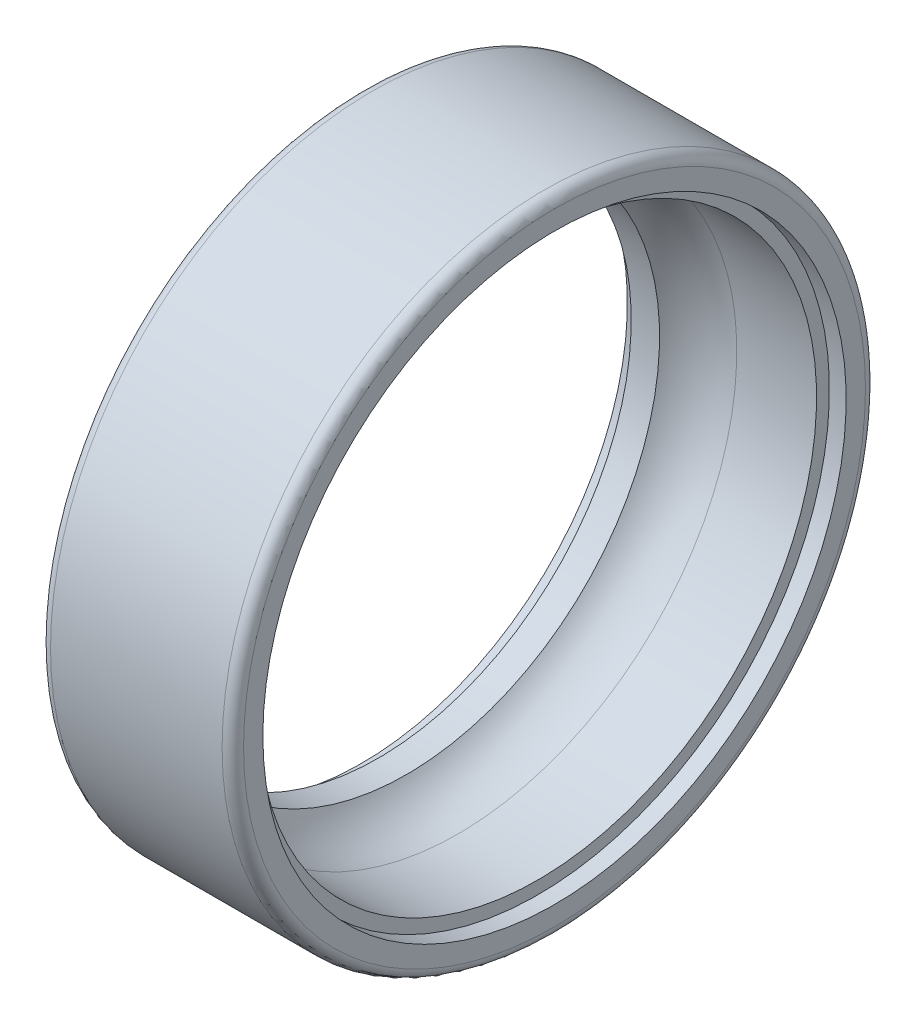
ISO-10303-21;
HEADER;
FILE_DESCRIPTION(('STEP AP214'),'2;1');
FILE_NAME('part.step','',(''),(''),'','','');
FILE_SCHEMA(('AUTOMOTIVE_DESIGN { 1 0 10303 214 1 1 1 1 }'));
ENDSEC;
DATA;
#1=APPLICATION_CONTEXT('core data for automotive mechanical design processes');
#2=APPLICATION_PROTOCOL_DEFINITION('international standard','automotive_design',2000,#1);
#3=PRODUCT_CONTEXT('',#1,'mechanical');
#4=PRODUCT('Part','Part','',(#3));
#5=PRODUCT_RELATED_PRODUCT_CATEGORY('part','',(#4));
#6=PRODUCT_DEFINITION_FORMATION('','',#4);
#7=PRODUCT_DEFINITION_CONTEXT('part definition',#1,'design');
#8=PRODUCT_DEFINITION('design','',#6,#7);
#9=PRODUCT_DEFINITION_SHAPE('','',#8);
#10=(LENGTH_UNIT() NAMED_UNIT(*) SI_UNIT(.MILLI.,.METRE.));
#11=(NAMED_UNIT(*) PLANE_ANGLE_UNIT() SI_UNIT($,.RADIAN.));
#12=(NAMED_UNIT(*) SI_UNIT($,.STERADIAN.) SOLID_ANGLE_UNIT());
#13=UNCERTAINTY_MEASURE_WITH_UNIT(LENGTH_MEASURE(1.E-05),#10,'distance_accuracy_value','');
#14=(GEOMETRIC_REPRESENTATION_CONTEXT(3) GLOBAL_UNCERTAINTY_ASSIGNED_CONTEXT((#13)) GLOBAL_UNIT_ASSIGNED_CONTEXT((#10,
#11,#12)) REPRESENTATION_CONTEXT('',''));
#15=CARTESIAN_POINT('',(0.,0.,0.));
#16=DIRECTION('',(0.,0.,1.));
#17=DIRECTION('',(1.,0.,0.));
#18=AXIS2_PLACEMENT_3D('',#15,#16,#17);
#19=CARTESIAN_POINT('',(4.5,0.,0.));
#20=DIRECTION('',(-1.,0.,0.));
#21=DIRECTION('',(0.,0.,1.));
#22=AXIS2_PLACEMENT_3D('',#19,#20,#21);
#23=TOROIDAL_SURFACE('',#22,10.,3.);
#24=CARTESIAN_POINT('',(2.1,0.,0.));
#25=DIRECTION('',(-1.,0.,0.));
#26=DIRECTION('',(0.,0.,1.));
#27=AXIS2_PLACEMENT_3D('',#24,#25,#26);
#28=CIRCLE('',#27,11.8);
#29=CARTESIAN_POINT('',(2.1,0.,11.8));
#30=VERTEX_POINT('',#29);
#31=EDGE_CURVE('E127',#30,#30,#28,.T.);
#32=ORIENTED_EDGE('',*,*,#31,.T.);
#33=EDGE_LOOP('',(#32));
#34=FACE_BOUND('',#33,.T.);
#35=CARTESIAN_POINT('',(4.5,0.,0.));
#36=DIRECTION('',(-1.,0.,0.));
#37=DIRECTION('',(0.,0.,1.));
#38=AXIS2_PLACEMENT_3D('',#35,#36,#37);
#39=CIRCLE('',#38,13.);
#40=CARTESIAN_POINT('',(4.5,0.,13.));
#41=VERTEX_POINT('',#40);
#42=EDGE_CURVE('E137',#41,#41,#39,.F.);
#43=ORIENTED_EDGE('',*,*,#42,.T.);
#44=EDGE_LOOP('',(#43));
#45=FACE_BOUND('',#44,.T.);
#46=ADVANCED_FACE('F14',(#34,#45),#23,.F.);
#47=CARTESIAN_POINT('',(1.44,0.,0.));
#48=DIRECTION('',(-1.,0.,0.));
#49=DIRECTION('',(0.,0.,1.));
#50=AXIS2_PLACEMENT_3D('',#47,#48,#49);
#51=CYLINDRICAL_SURFACE('',#50,11.8);
#52=CARTESIAN_POINT('',(0.78,0.,0.));
#53=DIRECTION('',(-1.,0.,0.));
#54=DIRECTION('',(0.,0.,1.));
#55=AXIS2_PLACEMENT_3D('',#52,#53,#54);
#56=CIRCLE('',#55,11.8);
#57=CARTESIAN_POINT('',(0.78,0.,11.8));
#58=VERTEX_POINT('',#57);
#59=EDGE_CURVE('E18',#58,#58,#56,.F.);
#60=ORIENTED_EDGE('',*,*,#59,.F.);
#61=EDGE_LOOP('',(#60));
#62=FACE_BOUND('',#61,.T.);
#63=ORIENTED_EDGE('',*,*,#31,.F.);
#64=EDGE_LOOP('',(#63));
#65=FACE_BOUND('',#64,.T.);
#66=ADVANCED_FACE('F97',(#62,#65),#51,.F.);
#67=CARTESIAN_POINT('',(6.36,0.,0.));
#68=DIRECTION('',(-1.,0.,0.));
#69=DIRECTION('',(0.,0.,1.));
#70=AXIS2_PLACEMENT_3D('',#67,#68,#69);
#71=CYLINDRICAL_SURFACE('',#70,13.);
#72=ORIENTED_EDGE('',*,*,#42,.F.);
#73=EDGE_LOOP('',(#72));
#74=FACE_BOUND('',#73,.T.);
#75=CARTESIAN_POINT('',(8.22,0.,0.));
#76=DIRECTION('',(-1.,0.,0.));
#77=DIRECTION('',(0.,0.,1.));
#78=AXIS2_PLACEMENT_3D('',#75,#76,#77);
#79=CIRCLE('',#78,13.);
#80=CARTESIAN_POINT('',(8.22,0.,13.));
#81=VERTEX_POINT('',#80);
#82=EDGE_CURVE('E133',#81,#81,#79,.T.);
#83=ORIENTED_EDGE('',*,*,#82,.F.);
#84=EDGE_LOOP('',(#83));
#85=FACE_BOUND('',#84,.T.);
#86=ADVANCED_FACE('F94',(#74,#85),#71,.F.);
#87=CARTESIAN_POINT('',(0.78,12.1,0.));
#88=DIRECTION('',(-1.,0.,0.));
#89=DIRECTION('',(0.,0.,1.));
#90=AXIS2_PLACEMENT_3D('',#87,#88,#89);
#91=PLANE('',#90);
#92=ORIENTED_EDGE('',*,*,#59,.T.);
#93=EDGE_LOOP('',(#92));
#94=FACE_BOUND('',#93,.T.);
#95=CARTESIAN_POINT('',(0.78,0.,0.));
#96=DIRECTION('',(-1.,0.,0.));
#97=DIRECTION('',(0.,0.,1.));
#98=AXIS2_PLACEMENT_3D('',#95,#96,#97);
#99=CIRCLE('',#98,12.4);
#100=CARTESIAN_POINT('',(0.78,0.,12.4));
#101=VERTEX_POINT('',#100);
#102=EDGE_CURVE('E131',#101,#101,#99,.T.);
#103=ORIENTED_EDGE('',*,*,#102,.T.);
#104=EDGE_LOOP('',(#103));
#105=FACE_BOUND('',#104,.T.);
#106=ADVANCED_FACE('F90',(#94,#105),#91,.T.);
#107=CARTESIAN_POINT('',(8.22,13.3,0.));
#108=DIRECTION('',(1.,0.,0.));
#109=DIRECTION('',(0.,0.,-1.));
#110=AXIS2_PLACEMENT_3D('',#107,#108,#109);
#111=PLANE('',#110);
#112=ORIENTED_EDGE('',*,*,#82,.T.);
#113=EDGE_LOOP('',(#112));
#114=FACE_BOUND('',#113,.T.);
#115=CARTESIAN_POINT('',(8.22,0.,0.));
#116=DIRECTION('',(-1.,0.,0.));
#117=DIRECTION('',(0.,0.,1.));
#118=AXIS2_PLACEMENT_3D('',#115,#116,#117);
#119=CIRCLE('',#118,13.6);
#120=CARTESIAN_POINT('',(8.22,0.,13.6));
#121=VERTEX_POINT('',#120);
#122=EDGE_CURVE('E124',#121,#121,#119,.F.);
#123=ORIENTED_EDGE('',*,*,#122,.T.);
#124=EDGE_LOOP('',(#123));
#125=FACE_BOUND('',#124,.T.);
#126=ADVANCED_FACE('F86',(#114,#125),#111,.T.);
#127=CARTESIAN_POINT('',(0.39,0.,0.));
#128=DIRECTION('',(-1.,0.,0.));
#129=DIRECTION('',(0.,0.,1.));
#130=AXIS2_PLACEMENT_3D('',#127,#128,#129);
#131=CYLINDRICAL_SURFACE('',#130,12.4);
#132=CARTESIAN_POINT('',(0.,0.,0.));
#133=DIRECTION('',(-1.,0.,0.));
#134=DIRECTION('',(0.,0.,1.));
#135=AXIS2_PLACEMENT_3D('',#132,#133,#134);
#136=CIRCLE('',#135,12.4);
#137=CARTESIAN_POINT('',(0.,0.,12.4));
#138=VERTEX_POINT('',#137);
#139=EDGE_CURVE('E119',#138,#138,#136,.F.);
#140=ORIENTED_EDGE('',*,*,#139,.F.);
#141=EDGE_LOOP('',(#140));
#142=FACE_BOUND('',#141,.T.);
#143=ORIENTED_EDGE('',*,*,#102,.F.);
#144=EDGE_LOOP('',(#143));
#145=FACE_BOUND('',#144,.T.);
#146=ADVANCED_FACE('F82',(#142,#145),#131,.F.);
#147=CARTESIAN_POINT('',(8.61,0.,0.));
#148=DIRECTION('',(-1.,0.,0.));
#149=DIRECTION('',(0.,0.,1.));
#150=AXIS2_PLACEMENT_3D('',#147,#148,#149);
#151=CYLINDRICAL_SURFACE('',#150,13.6);
#152=ORIENTED_EDGE('',*,*,#122,.F.);
#153=EDGE_LOOP('',(#152));
#154=FACE_BOUND('',#153,.T.);
#155=CARTESIAN_POINT('',(9.,0.,0.));
#156=DIRECTION('',(-1.,0.,0.));
#157=DIRECTION('',(0.,0.,1.));
#158=AXIS2_PLACEMENT_3D('',#155,#156,#157);
#159=CIRCLE('',#158,13.6);
#160=CARTESIAN_POINT('',(9.,0.,13.6));
#161=VERTEX_POINT('',#160);
#162=EDGE_CURVE('E117',#161,#161,#159,.T.);
#163=ORIENTED_EDGE('',*,*,#162,.F.);
#164=EDGE_LOOP('',(#163));
#165=FACE_BOUND('',#164,.T.);
#166=ADVANCED_FACE('F77',(#154,#165),#151,.F.);
#167=CARTESIAN_POINT('',(0.,13.45,0.));
#168=DIRECTION('',(-1.,0.,0.));
#169=DIRECTION('',(0.,0.,1.));
#170=AXIS2_PLACEMENT_3D('',#167,#168,#169);
#171=PLANE('',#170);
#172=ORIENTED_EDGE('',*,*,#139,.T.);
#173=EDGE_LOOP('',(#172));
#174=FACE_BOUND('',#173,.T.);
#175=CARTESIAN_POINT('',(0.,0.,0.));
#176=DIRECTION('',(1.,0.,0.));
#177=DIRECTION('',(0.,0.,-1.));
#178=AXIS2_PLACEMENT_3D('',#175,#176,#177);
#179=CIRCLE('',#178,14.5);
#180=CARTESIAN_POINT('',(0.,0.,-14.5));
#181=VERTEX_POINT('',#180);
#182=EDGE_CURVE('E61',#181,#181,#179,.T.);
#183=ORIENTED_EDGE('',*,*,#182,.F.);
#184=EDGE_LOOP('',(#183));
#185=FACE_BOUND('',#184,.T.);
#186=ADVANCED_FACE('F67',(#174,#185),#171,.T.);
#187=CARTESIAN_POINT('',(9.,14.05,0.));
#188=DIRECTION('',(1.,0.,0.));
#189=DIRECTION('',(0.,0.,-1.));
#190=AXIS2_PLACEMENT_3D('',#187,#188,#189);
#191=PLANE('',#190);
#192=ORIENTED_EDGE('',*,*,#162,.T.);
#193=EDGE_LOOP('',(#192));
#194=FACE_BOUND('',#193,.T.);
#195=CARTESIAN_POINT('',(9.,0.,0.));
#196=DIRECTION('',(-1.,0.,0.));
#197=DIRECTION('',(0.,0.,-1.));
#198=AXIS2_PLACEMENT_3D('',#195,#196,#197);
#199=CIRCLE('',#198,14.5);
#200=CARTESIAN_POINT('',(9.,0.,-14.5));
#201=VERTEX_POINT('',#200);
#202=EDGE_CURVE('E27',#201,#201,#199,.T.);
#203=ORIENTED_EDGE('',*,*,#202,.F.);
#204=EDGE_LOOP('',(#203));
#205=FACE_BOUND('',#204,.T.);
#206=ADVANCED_FACE('F76',(#194,#205),#191,.T.);
#207=CARTESIAN_POINT('',(0.500000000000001,0.,0.));
#208=DIRECTION('',(-1.,0.,0.));
#209=DIRECTION('',(0.,0.,1.));
#210=AXIS2_PLACEMENT_3D('',#207,#208,#209);
#211=TOROIDAL_SURFACE('',#210,14.5,0.500000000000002);
#212=CARTESIAN_POINT('',(0.5,0.,0.));
#213=DIRECTION('',(-1.,0.,0.));
#214=DIRECTION('',(0.,0.,1.));
#215=AXIS2_PLACEMENT_3D('',#212,#213,#214);
#216=CIRCLE('',#215,15.);
#217=CARTESIAN_POINT('',(0.5,0.,15.));
#218=VERTEX_POINT('',#217);
#219=EDGE_CURVE('E22',#218,#218,#216,.F.);
#220=ORIENTED_EDGE('',*,*,#219,.F.);
#221=EDGE_LOOP('',(#220));
#222=FACE_BOUND('',#221,.T.);
#223=ORIENTED_EDGE('',*,*,#182,.T.);
#224=EDGE_LOOP('',(#223));
#225=FACE_BOUND('',#224,.T.);
#226=ADVANCED_FACE('F41',(#222,#225),#211,.T.);
#227=CARTESIAN_POINT('',(8.5,0.,0.));
#228=DIRECTION('',(-1.,0.,0.));
#229=DIRECTION('',(0.,0.,1.));
#230=AXIS2_PLACEMENT_3D('',#227,#228,#229);
#231=TOROIDAL_SURFACE('',#230,14.5,0.500000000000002);
#232=ORIENTED_EDGE('',*,*,#202,.T.);
#233=EDGE_LOOP('',(#232));
#234=FACE_BOUND('',#233,.T.);
#235=CARTESIAN_POINT('',(8.5,0.,0.));
#236=DIRECTION('',(-1.,0.,0.));
#237=DIRECTION('',(0.,0.,1.));
#238=AXIS2_PLACEMENT_3D('',#235,#236,#237);
#239=CIRCLE('',#238,15.);
#240=CARTESIAN_POINT('',(8.5,0.,15.));
#241=VERTEX_POINT('',#240);
#242=EDGE_CURVE('E10',#241,#241,#239,.T.);
#243=ORIENTED_EDGE('',*,*,#242,.F.);
#244=EDGE_LOOP('',(#243));
#245=FACE_BOUND('',#244,.T.);
#246=ADVANCED_FACE('F35',(#234,#245),#231,.T.);
#247=CARTESIAN_POINT('',(4.5,0.,0.));
#248=DIRECTION('',(-1.,0.,0.));
#249=DIRECTION('',(0.,0.,1.));
#250=AXIS2_PLACEMENT_3D('',#247,#248,#249);
#251=CYLINDRICAL_SURFACE('',#250,15.);
#252=ORIENTED_EDGE('',*,*,#219,.T.);
#253=EDGE_LOOP('',(#252));
#254=FACE_BOUND('',#253,.T.);
#255=ORIENTED_EDGE('',*,*,#242,.T.);
#256=EDGE_LOOP('',(#255));
#257=FACE_BOUND('',#256,.T.);
#258=ADVANCED_FACE('F40',(#254,#257),#251,.T.);
#259=CLOSED_SHELL('',(#46,#66,#86,#106,#126,#146,#166,#186,#206,#226,#246,#258));
#260=MANIFOLD_SOLID_BREP('B1',#259);
#261=ADVANCED_BREP_SHAPE_REPRESENTATION('',(#18,#260),#14);
#262=SHAPE_DEFINITION_REPRESENTATION(#9,#261);
ENDSEC;
END-ISO-10303-21;
